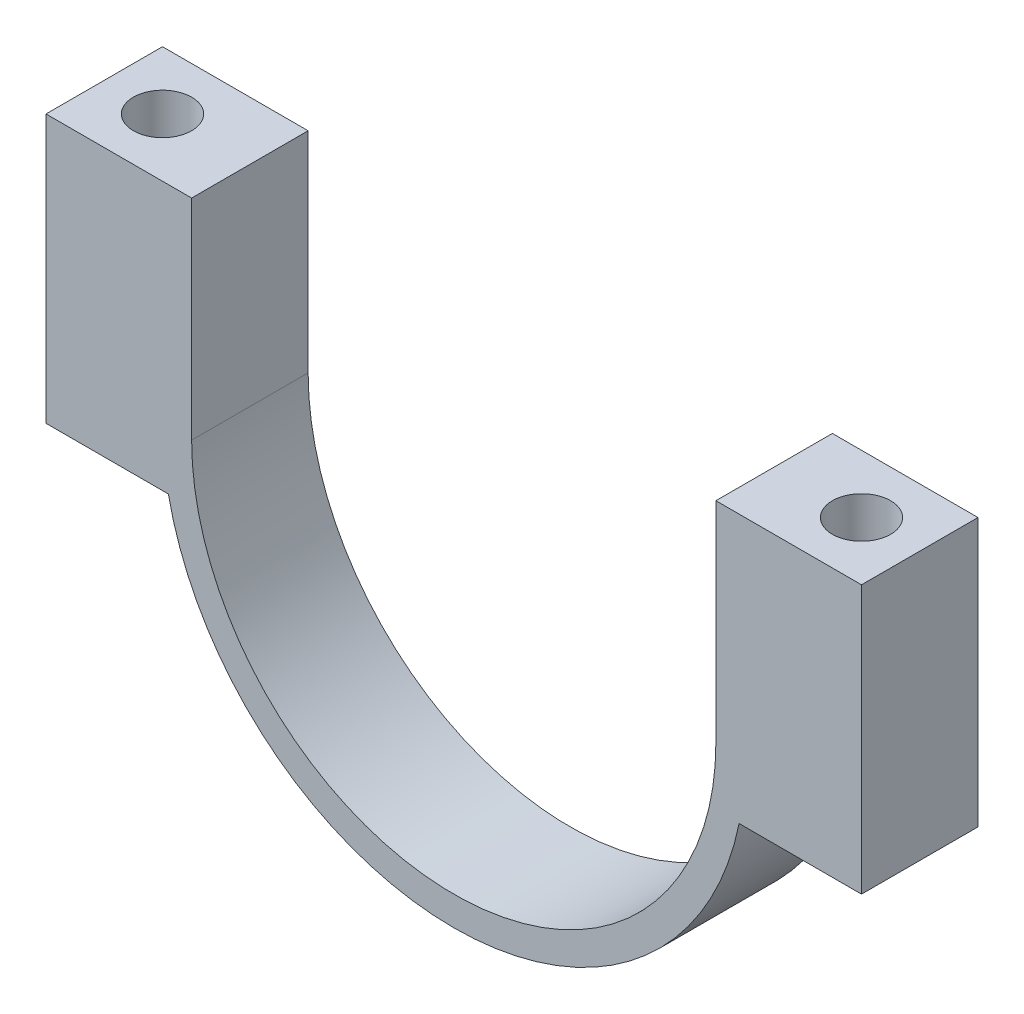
from build123d import *

# Parameters (mm, degrees)
BOSS_EXTRUDE1_DEPTH = 20
SKETCH2_R           = 5
CUT_EXTRUDE1_DEPTH  = 84.066238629
SKETCH3_W           = 25
SKETCH3_H           = 20
SKETCH3_R           = 5
BOSS_EXTRUDE2_DEPTH = 36


with BuildPart() as part:
    # Sketch1 → Boss-Extrude1 (new body)
    with BuildSketch(Plane.XY):
        with BuildLine():
            Line((70, 0), (45, 0))
            ThreePointArc((45, 0), (0, -45), (-45, 0))
            Line((-45, 0), (-70, 0))
            Line((-70, 0), (-70, -10))
            Line((-70, -10), (-48.989794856, -10))
            ThreePointArc((-48.989794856, -10), (0, -50), (48.989794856, -10))
            Line((48.989794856, -10), (70, -10))
            Line((70, -10), (70, 0))
        make_face()
    extrude(amount=BOSS_EXTRUDE1_DEPTH)

    # Sketch2 → Cut-Extrude1 (cut, through all)
    with BuildSketch(Plane.XZ.offset(10)):
        with Locations((60, 10)):
            Circle(SKETCH2_R)
        with Locations(Location((-60, 10, 0), (0, 0, 180))):
            Circle(SKETCH2_R)
    extrude(amount=-CUT_EXTRUDE1_DEPTH, mode=Mode.SUBTRACT)

    # Sketch3 → Boss-Extrude2 (add)
    # profile 1 of 2: a face of its own
    with BuildSketch(Plane(origin=(0, 0, 0), x_dir=(1, 0, 0), z_dir=(0, 1, 0))):
        with Locations((57.5, -10)):
            Rectangle(SKETCH3_W, SKETCH3_H)
        with Locations((60, -10)):
            Circle(SKETCH3_R, mode=Mode.SUBTRACT)
    # profile 2 of 2: a face of its own
    with BuildSketch(Plane(origin=(0, 0, 0), x_dir=(1, 0, 0), z_dir=(0, 1, 0))):
        with Locations((-57.5, -10)):
            Rectangle(SKETCH3_W, SKETCH3_H)
        with Locations(Location((-60, -10, 0), (0, 0, 180))):
            Circle(SKETCH3_R, mode=Mode.SUBTRACT)
    extrude(amount=BOSS_EXTRUDE2_DEPTH)


solid = part.part
